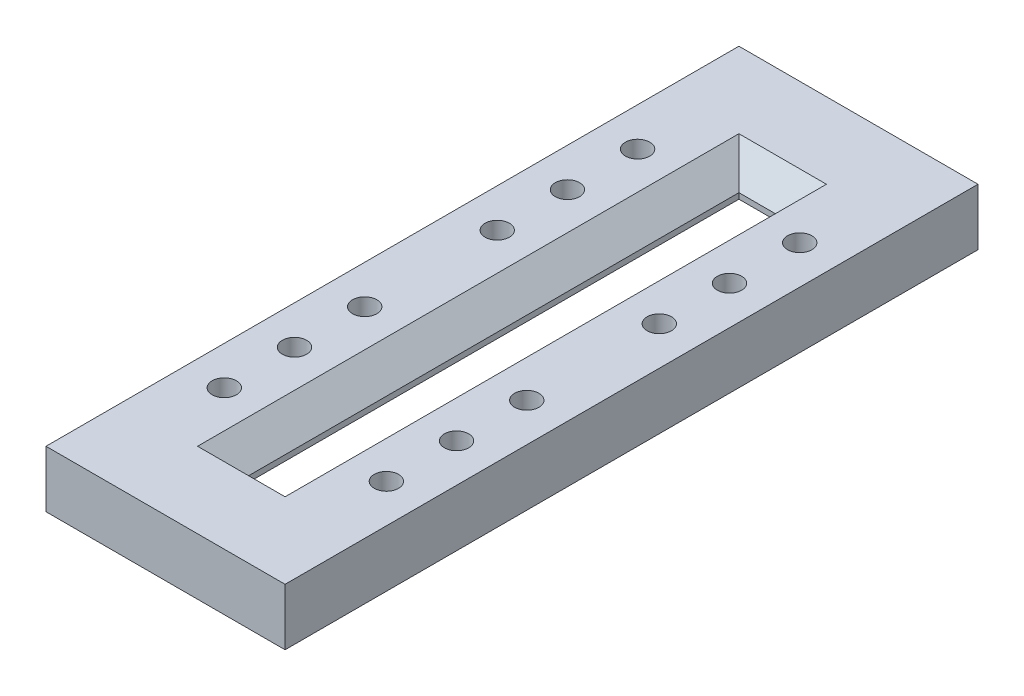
ISO-10303-21;
HEADER;
FILE_DESCRIPTION(('STEP AP214'),'2;1');
FILE_NAME('part.step','',(''),(''),'','','');
FILE_SCHEMA(('AUTOMOTIVE_DESIGN { 1 0 10303 214 1 1 1 1 }'));
ENDSEC;
DATA;
#1=APPLICATION_CONTEXT('core data for automotive mechanical design processes');
#2=APPLICATION_PROTOCOL_DEFINITION('international standard','automotive_design',2000,#1);
#3=PRODUCT_CONTEXT('',#1,'mechanical');
#4=PRODUCT('Part','Part','',(#3));
#5=PRODUCT_RELATED_PRODUCT_CATEGORY('part','',(#4));
#6=PRODUCT_DEFINITION_FORMATION('','',#4);
#7=PRODUCT_DEFINITION_CONTEXT('part definition',#1,'design');
#8=PRODUCT_DEFINITION('design','',#6,#7);
#9=PRODUCT_DEFINITION_SHAPE('','',#8);
#10=(LENGTH_UNIT() NAMED_UNIT(*) SI_UNIT(.MILLI.,.METRE.));
#11=(NAMED_UNIT(*) PLANE_ANGLE_UNIT() SI_UNIT($,.RADIAN.));
#12=(NAMED_UNIT(*) SI_UNIT($,.STERADIAN.) SOLID_ANGLE_UNIT());
#13=UNCERTAINTY_MEASURE_WITH_UNIT(LENGTH_MEASURE(1.E-05),#10,'distance_accuracy_value','');
#14=(GEOMETRIC_REPRESENTATION_CONTEXT(3) GLOBAL_UNCERTAINTY_ASSIGNED_CONTEXT((#13)) GLOBAL_UNIT_ASSIGNED_CONTEXT((#10,
#11,#12)) REPRESENTATION_CONTEXT('',''));
#15=CARTESIAN_POINT('',(0.,0.,0.));
#16=DIRECTION('',(0.,0.,1.));
#17=DIRECTION('',(1.,0.,0.));
#18=AXIS2_PLACEMENT_3D('',#15,#16,#17);
#19=CARTESIAN_POINT('',(0.,88.9,0.));
#20=DIRECTION('',(0.,1.,0.));
#21=DIRECTION('',(0.,0.,1.));
#22=AXIS2_PLACEMENT_3D('',#19,#20,#21);
#23=PLANE('',#22);
#24=DIRECTION('',(0.,0.,-1.));
#25=VECTOR('',#24,1.);
#26=CARTESIAN_POINT('',(-68.5750000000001,88.9,0.));
#27=LINE('',#26,#25);
#28=CARTESIAN_POINT('',(-68.5750000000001,88.9,424.175));
#29=VERTEX_POINT('',#28);
#30=CARTESIAN_POINT('',(-68.5750000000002,88.9,-424.175));
#31=VERTEX_POINT('',#30);
#32=EDGE_CURVE('E212',#29,#31,#27,.T.);
#33=ORIENTED_EDGE('',*,*,#32,.T.);
#34=DIRECTION('',(1.,0.,0.));
#35=VECTOR('',#34,1.);
#36=CARTESIAN_POINT('',(0.,88.9,-424.175));
#37=LINE('',#36,#35);
#38=CARTESIAN_POINT('',(68.5750000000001,88.9,-424.175));
#39=VERTEX_POINT('',#38);
#40=EDGE_CURVE('E11',#31,#39,#37,.T.);
#41=ORIENTED_EDGE('',*,*,#40,.T.);
#42=DIRECTION('',(0.,0.,1.));
#43=VECTOR('',#42,1.);
#44=CARTESIAN_POINT('',(68.5750000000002,88.9,0.));
#45=LINE('',#44,#43);
#46=CARTESIAN_POINT('',(68.5750000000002,88.9,424.175));
#47=VERTEX_POINT('',#46);
#48=EDGE_CURVE('E60',#39,#47,#45,.T.);
#49=ORIENTED_EDGE('',*,*,#48,.T.);
#50=DIRECTION('',(-1.,0.,0.));
#51=VECTOR('',#50,1.);
#52=CARTESIAN_POINT('',(0.,88.9,424.175));
#53=LINE('',#52,#51);
#54=EDGE_CURVE('E211',#47,#29,#53,.T.);
#55=ORIENTED_EDGE('',*,*,#54,.T.);
#56=EDGE_LOOP('',(#33,#41,#49,#55));
#57=FACE_BOUND('',#56,.T.);
#58=CARTESIAN_POINT('',(126.999999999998,88.9,103.85));
#59=DIRECTION('',(0.,1.,0.));
#60=DIRECTION('',(0.,0.,1.));
#61=AXIS2_PLACEMENT_3D('',#58,#59,#60);
#62=CIRCLE('',#61,19.05);
#63=CARTESIAN_POINT('',(126.999999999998,88.9,122.9));
#64=VERTEX_POINT('',#63);
#65=EDGE_CURVE('E398',#64,#64,#62,.T.);
#66=ORIENTED_EDGE('',*,*,#65,.F.);
#67=EDGE_LOOP('',(#66));
#68=FACE_BOUND('',#67,.T.);
#69=CARTESIAN_POINT('',(127.000000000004,88.9,-213.85));
#70=DIRECTION('',(0.,1.,0.));
#71=DIRECTION('',(0.,0.,1.));
#72=AXIS2_PLACEMENT_3D('',#69,#70,#71);
#73=CIRCLE('',#72,19.05);
#74=CARTESIAN_POINT('',(127.000000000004,88.9,-194.8));
#75=VERTEX_POINT('',#74);
#76=EDGE_CURVE('E442',#75,#75,#73,.T.);
#77=ORIENTED_EDGE('',*,*,#76,.F.);
#78=EDGE_LOOP('',(#77));
#79=FACE_BOUND('',#78,.T.);
#80=CARTESIAN_POINT('',(-126.999999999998,88.9,-213.85));
#81=DIRECTION('',(0.,1.,0.));
#82=DIRECTION('',(0.,0.,1.));
#83=AXIS2_PLACEMENT_3D('',#80,#81,#82);
#84=CIRCLE('',#83,19.05);
#85=CARTESIAN_POINT('',(-126.999999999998,88.9,-194.8));
#86=VERTEX_POINT('',#85);
#87=EDGE_CURVE('E434',#86,#86,#84,.T.);
#88=ORIENTED_EDGE('',*,*,#87,.F.);
#89=EDGE_LOOP('',(#88));
#90=FACE_BOUND('',#89,.T.);
#91=CARTESIAN_POINT('',(-127.000000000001,88.9,213.85));
#92=DIRECTION('',(0.,1.,0.));
#93=DIRECTION('',(0.,0.,1.));
#94=AXIS2_PLACEMENT_3D('',#91,#92,#93);
#95=CIRCLE('',#94,19.05);
#96=CARTESIAN_POINT('',(-127.000000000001,88.9,232.9));
#97=VERTEX_POINT('',#96);
#98=EDGE_CURVE('E430',#97,#97,#95,.T.);
#99=ORIENTED_EDGE('',*,*,#98,.F.);
#100=EDGE_LOOP('',(#99));
#101=FACE_BOUND('',#100,.T.);
#102=CARTESIAN_POINT('',(127.000000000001,88.9,213.85));
#103=DIRECTION('',(0.,1.,0.));
#104=DIRECTION('',(0.,0.,1.));
#105=AXIS2_PLACEMENT_3D('',#102,#103,#104);
#106=CIRCLE('',#105,19.05);
#107=CARTESIAN_POINT('',(127.000000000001,88.9,232.9));
#108=VERTEX_POINT('',#107);
#109=EDGE_CURVE('E428',#108,#108,#106,.T.);
#110=ORIENTED_EDGE('',*,*,#109,.F.);
#111=EDGE_LOOP('',(#110));
#112=FACE_BOUND('',#111,.T.);
#113=CARTESIAN_POINT('',(127.000000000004,88.9,-323.85));
#114=DIRECTION('',(0.,1.,0.));
#115=DIRECTION('',(0.,0.,1.));
#116=AXIS2_PLACEMENT_3D('',#113,#114,#115);
#117=CIRCLE('',#116,19.05);
#118=CARTESIAN_POINT('',(127.000000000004,88.9,-304.8));
#119=VERTEX_POINT('',#118);
#120=EDGE_CURVE('E472',#119,#119,#117,.T.);
#121=ORIENTED_EDGE('',*,*,#120,.F.);
#122=EDGE_LOOP('',(#121));
#123=FACE_BOUND('',#122,.T.);
#124=CARTESIAN_POINT('',(-126.999999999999,88.9,-323.85));
#125=DIRECTION('',(0.,1.,0.));
#126=DIRECTION('',(0.,0.,1.));
#127=AXIS2_PLACEMENT_3D('',#124,#125,#126);
#128=CIRCLE('',#127,19.05);
#129=CARTESIAN_POINT('',(-126.999999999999,88.9,-304.8));
#130=VERTEX_POINT('',#129);
#131=EDGE_CURVE('E463',#130,#130,#128,.T.);
#132=ORIENTED_EDGE('',*,*,#131,.F.);
#133=EDGE_LOOP('',(#132));
#134=FACE_BOUND('',#133,.T.);
#135=CARTESIAN_POINT('',(-126.999999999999,88.9,323.85));
#136=DIRECTION('',(0.,1.,0.));
#137=DIRECTION('',(0.,0.,1.));
#138=AXIS2_PLACEMENT_3D('',#135,#136,#137);
#139=CIRCLE('',#138,19.05);
#140=CARTESIAN_POINT('',(-126.999999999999,88.9,342.9));
#141=VERTEX_POINT('',#140);
#142=EDGE_CURVE('E453',#141,#141,#139,.T.);
#143=ORIENTED_EDGE('',*,*,#142,.F.);
#144=EDGE_LOOP('',(#143));
#145=FACE_BOUND('',#144,.T.);
#146=CARTESIAN_POINT('',(-127.000000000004,88.9,103.85));
#147=DIRECTION('',(0.,1.,0.));
#148=DIRECTION('',(0.,0.,1.));
#149=AXIS2_PLACEMENT_3D('',#146,#147,#148);
#150=CIRCLE('',#149,19.05);
#151=CARTESIAN_POINT('',(-127.000000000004,88.9,122.9));
#152=VERTEX_POINT('',#151);
#153=EDGE_CURVE('E391',#152,#152,#150,.T.);
#154=ORIENTED_EDGE('',*,*,#153,.F.);
#155=EDGE_LOOP('',(#154));
#156=FACE_BOUND('',#155,.T.);
#157=CARTESIAN_POINT('',(-126.999999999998,88.9,-103.85));
#158=DIRECTION('',(0.,1.,0.));
#159=DIRECTION('',(0.,0.,1.));
#160=AXIS2_PLACEMENT_3D('',#157,#158,#159);
#161=CIRCLE('',#160,19.05);
#162=CARTESIAN_POINT('',(-126.999999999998,88.9,-84.8000000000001));
#163=VERTEX_POINT('',#162);
#164=EDGE_CURVE('E414',#163,#163,#161,.T.);
#165=ORIENTED_EDGE('',*,*,#164,.F.);
#166=EDGE_LOOP('',(#165));
#167=FACE_BOUND('',#166,.T.);
#168=CARTESIAN_POINT('',(127.000000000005,88.9,-103.85));
#169=DIRECTION('',(0.,1.,0.));
#170=DIRECTION('',(0.,0.,1.));
#171=AXIS2_PLACEMENT_3D('',#168,#169,#170);
#172=CIRCLE('',#171,19.05);
#173=CARTESIAN_POINT('',(127.000000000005,88.9,-84.8000000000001));
#174=VERTEX_POINT('',#173);
#175=EDGE_CURVE('E231',#174,#174,#172,.T.);
#176=ORIENTED_EDGE('',*,*,#175,.F.);
#177=EDGE_LOOP('',(#176));
#178=FACE_BOUND('',#177,.T.);
#179=CARTESIAN_POINT('',(127.000000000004,88.9,323.85));
#180=DIRECTION('',(0.,1.,0.));
#181=DIRECTION('',(0.,0.,1.));
#182=AXIS2_PLACEMENT_3D('',#179,#180,#181);
#183=CIRCLE('',#182,19.05);
#184=CARTESIAN_POINT('',(127.000000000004,88.9,342.9));
#185=VERTEX_POINT('',#184);
#186=EDGE_CURVE('E280',#185,#185,#183,.T.);
#187=ORIENTED_EDGE('',*,*,#186,.F.);
#188=EDGE_LOOP('',(#187));
#189=FACE_BOUND('',#188,.T.);
#190=DIRECTION('',(1.,0.,0.));
#191=VECTOR('',#190,1.);
#192=CARTESIAN_POINT('',(-187.325,88.9,542.925));
#193=LINE('',#192,#191);
#194=CARTESIAN_POINT('',(-187.325,88.9,542.925));
#195=VERTEX_POINT('',#194);
#196=CARTESIAN_POINT('',(187.325,88.9,542.925));
#197=VERTEX_POINT('',#196);
#198=EDGE_CURVE('E154',#195,#197,#193,.T.);
#199=ORIENTED_EDGE('',*,*,#198,.T.);
#200=DIRECTION('',(0.,0.,-1.));
#201=VECTOR('',#200,1.);
#202=CARTESIAN_POINT('',(187.325,88.9,542.925));
#203=LINE('',#202,#201);
#204=CARTESIAN_POINT('',(187.325,88.9,-542.925));
#205=VERTEX_POINT('',#204);
#206=EDGE_CURVE('E139',#197,#205,#203,.T.);
#207=ORIENTED_EDGE('',*,*,#206,.T.);
#208=DIRECTION('',(-1.,0.,0.));
#209=VECTOR('',#208,1.);
#210=CARTESIAN_POINT('',(187.325,88.9,-542.925));
#211=LINE('',#210,#209);
#212=CARTESIAN_POINT('',(-187.325,88.9,-542.925));
#213=VERTEX_POINT('',#212);
#214=EDGE_CURVE('E148',#205,#213,#211,.T.);
#215=ORIENTED_EDGE('',*,*,#214,.T.);
#216=DIRECTION('',(0.,0.,1.));
#217=VECTOR('',#216,1.);
#218=CARTESIAN_POINT('',(-187.325,88.9,-542.925));
#219=LINE('',#218,#217);
#220=EDGE_CURVE('E152',#213,#195,#219,.T.);
#221=ORIENTED_EDGE('',*,*,#220,.T.);
#222=EDGE_LOOP('',(#199,#207,#215,#221));
#223=FACE_BOUND('',#222,.T.);
#224=ADVANCED_FACE('F46',(#57,#68,#79,#90,#101,#112,#123,#134,#145,#156,#167,#178,#189,#223),
#23,.T.);
#225=CARTESIAN_POINT('',(0.,0.,0.));
#226=DIRECTION('',(0.,1.,0.));
#227=DIRECTION('',(0.,0.,1.));
#228=AXIS2_PLACEMENT_3D('',#225,#226,#227);
#229=PLANE('',#228);
#230=DIRECTION('',(-1.,0.,0.));
#231=VECTOR('',#230,1.);
#232=CARTESIAN_POINT('',(-28.575,0.,-424.175));
#233=LINE('',#232,#231);
#234=CARTESIAN_POINT('',(68.5750000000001,0.,-424.175));
#235=VERTEX_POINT('',#234);
#236=CARTESIAN_POINT('',(-68.5750000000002,0.,-424.175));
#237=VERTEX_POINT('',#236);
#238=EDGE_CURVE('E167',#235,#237,#233,.T.);
#239=ORIENTED_EDGE('',*,*,#238,.T.);
#240=DIRECTION('',(0.,0.,1.));
#241=VECTOR('',#240,1.);
#242=CARTESIAN_POINT('',(-68.5750000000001,0.,384.175));
#243=LINE('',#242,#241);
#244=CARTESIAN_POINT('',(-68.5750000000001,0.,424.175));
#245=VERTEX_POINT('',#244);
#246=EDGE_CURVE('E181',#237,#245,#243,.T.);
#247=ORIENTED_EDGE('',*,*,#246,.T.);
#248=DIRECTION('',(1.,0.,0.));
#249=VECTOR('',#248,1.);
#250=CARTESIAN_POINT('',(28.575,0.,424.175));
#251=LINE('',#250,#249);
#252=CARTESIAN_POINT('',(68.5750000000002,0.,424.175));
#253=VERTEX_POINT('',#252);
#254=EDGE_CURVE('E178',#245,#253,#251,.T.);
#255=ORIENTED_EDGE('',*,*,#254,.T.);
#256=DIRECTION('',(0.,0.,-1.));
#257=VECTOR('',#256,1.);
#258=CARTESIAN_POINT('',(68.5750000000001,0.,-384.175));
#259=LINE('',#258,#257);
#260=EDGE_CURVE('E168',#253,#235,#259,.T.);
#261=ORIENTED_EDGE('',*,*,#260,.T.);
#262=EDGE_LOOP('',(#239,#247,#255,#261));
#263=FACE_BOUND('',#262,.T.);
#264=CARTESIAN_POINT('',(126.999999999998,0.,103.85));
#265=DIRECTION('',(0.,1.,0.));
#266=DIRECTION('',(0.,0.,1.));
#267=AXIS2_PLACEMENT_3D('',#264,#265,#266);
#268=CIRCLE('',#267,19.05);
#269=CARTESIAN_POINT('',(126.999999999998,0.,122.9));
#270=VERTEX_POINT('',#269);
#271=EDGE_CURVE('E401',#270,#270,#268,.T.);
#272=ORIENTED_EDGE('',*,*,#271,.T.);
#273=EDGE_LOOP('',(#272));
#274=FACE_BOUND('',#273,.T.);
#275=CARTESIAN_POINT('',(127.000000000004,0.,-213.85));
#276=DIRECTION('',(0.,1.,0.));
#277=DIRECTION('',(0.,0.,1.));
#278=AXIS2_PLACEMENT_3D('',#275,#276,#277);
#279=CIRCLE('',#278,19.05);
#280=CARTESIAN_POINT('',(127.000000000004,0.,-194.8));
#281=VERTEX_POINT('',#280);
#282=EDGE_CURVE('E437',#281,#281,#279,.T.);
#283=ORIENTED_EDGE('',*,*,#282,.T.);
#284=EDGE_LOOP('',(#283));
#285=FACE_BOUND('',#284,.T.);
#286=CARTESIAN_POINT('',(-126.999999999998,0.,-213.85));
#287=DIRECTION('',(0.,1.,0.));
#288=DIRECTION('',(0.,0.,1.));
#289=AXIS2_PLACEMENT_3D('',#286,#287,#288);
#290=CIRCLE('',#289,19.05);
#291=CARTESIAN_POINT('',(-126.999999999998,0.,-194.8));
#292=VERTEX_POINT('',#291);
#293=EDGE_CURVE('E431',#292,#292,#290,.T.);
#294=ORIENTED_EDGE('',*,*,#293,.T.);
#295=EDGE_LOOP('',(#294));
#296=FACE_BOUND('',#295,.T.);
#297=CARTESIAN_POINT('',(-127.000000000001,0.,213.85));
#298=DIRECTION('',(0.,1.,0.));
#299=DIRECTION('',(0.,0.,1.));
#300=AXIS2_PLACEMENT_3D('',#297,#298,#299);
#301=CIRCLE('',#300,19.05);
#302=CARTESIAN_POINT('',(-127.000000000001,0.,232.9));
#303=VERTEX_POINT('',#302);
#304=EDGE_CURVE('E422',#303,#303,#301,.T.);
#305=ORIENTED_EDGE('',*,*,#304,.T.);
#306=EDGE_LOOP('',(#305));
#307=FACE_BOUND('',#306,.T.);
#308=CARTESIAN_POINT('',(127.000000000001,0.,213.85));
#309=DIRECTION('',(0.,1.,0.));
#310=DIRECTION('',(0.,0.,1.));
#311=AXIS2_PLACEMENT_3D('',#308,#309,#310);
#312=CIRCLE('',#311,19.05);
#313=CARTESIAN_POINT('',(127.000000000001,0.,232.9));
#314=VERTEX_POINT('',#313);
#315=EDGE_CURVE('E473',#314,#314,#312,.T.);
#316=ORIENTED_EDGE('',*,*,#315,.T.);
#317=EDGE_LOOP('',(#316));
#318=FACE_BOUND('',#317,.T.);
#319=CARTESIAN_POINT('',(127.000000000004,0.,-323.85));
#320=DIRECTION('',(0.,1.,0.));
#321=DIRECTION('',(0.,0.,1.));
#322=AXIS2_PLACEMENT_3D('',#319,#320,#321);
#323=CIRCLE('',#322,19.05);
#324=CARTESIAN_POINT('',(127.000000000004,0.,-304.8));
#325=VERTEX_POINT('',#324);
#326=EDGE_CURVE('E470',#325,#325,#323,.T.);
#327=ORIENTED_EDGE('',*,*,#326,.T.);
#328=EDGE_LOOP('',(#327));
#329=FACE_BOUND('',#328,.T.);
#330=CARTESIAN_POINT('',(-126.999999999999,0.,-323.85));
#331=DIRECTION('',(0.,1.,0.));
#332=DIRECTION('',(0.,0.,1.));
#333=AXIS2_PLACEMENT_3D('',#330,#331,#332);
#334=CIRCLE('',#333,19.05);
#335=CARTESIAN_POINT('',(-126.999999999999,0.,-304.8));
#336=VERTEX_POINT('',#335);
#337=EDGE_CURVE('E458',#336,#336,#334,.T.);
#338=ORIENTED_EDGE('',*,*,#337,.T.);
#339=EDGE_LOOP('',(#338));
#340=FACE_BOUND('',#339,.T.);
#341=CARTESIAN_POINT('',(-126.999999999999,0.,323.85));
#342=DIRECTION('',(0.,1.,0.));
#343=DIRECTION('',(0.,0.,1.));
#344=AXIS2_PLACEMENT_3D('',#341,#342,#343);
#345=CIRCLE('',#344,19.05);
#346=CARTESIAN_POINT('',(-126.999999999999,0.,342.9));
#347=VERTEX_POINT('',#346);
#348=EDGE_CURVE('E448',#347,#347,#345,.T.);
#349=ORIENTED_EDGE('',*,*,#348,.T.);
#350=EDGE_LOOP('',(#349));
#351=FACE_BOUND('',#350,.T.);
#352=CARTESIAN_POINT('',(-127.000000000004,0.,103.85));
#353=DIRECTION('',(0.,1.,0.));
#354=DIRECTION('',(0.,0.,1.));
#355=AXIS2_PLACEMENT_3D('',#352,#353,#354);
#356=CIRCLE('',#355,19.05);
#357=CARTESIAN_POINT('',(-127.000000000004,0.,122.9));
#358=VERTEX_POINT('',#357);
#359=EDGE_CURVE('E392',#358,#358,#356,.T.);
#360=ORIENTED_EDGE('',*,*,#359,.T.);
#361=EDGE_LOOP('',(#360));
#362=FACE_BOUND('',#361,.T.);
#363=CARTESIAN_POINT('',(-126.999999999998,0.,-103.85));
#364=DIRECTION('',(0.,1.,0.));
#365=DIRECTION('',(0.,0.,1.));
#366=AXIS2_PLACEMENT_3D('',#363,#364,#365);
#367=CIRCLE('',#366,19.05);
#368=CARTESIAN_POINT('',(-126.999999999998,0.,-84.8000000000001));
#369=VERTEX_POINT('',#368);
#370=EDGE_CURVE('E403',#369,#369,#367,.T.);
#371=ORIENTED_EDGE('',*,*,#370,.T.);
#372=EDGE_LOOP('',(#371));
#373=FACE_BOUND('',#372,.T.);
#374=CARTESIAN_POINT('',(127.000000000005,0.,-103.85));
#375=DIRECTION('',(0.,1.,0.));
#376=DIRECTION('',(0.,0.,1.));
#377=AXIS2_PLACEMENT_3D('',#374,#375,#376);
#378=CIRCLE('',#377,19.05);
#379=CARTESIAN_POINT('',(127.000000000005,0.,-84.8000000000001));
#380=VERTEX_POINT('',#379);
#381=EDGE_CURVE('E412',#380,#380,#378,.T.);
#382=ORIENTED_EDGE('',*,*,#381,.T.);
#383=EDGE_LOOP('',(#382));
#384=FACE_BOUND('',#383,.T.);
#385=CARTESIAN_POINT('',(127.000000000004,0.,323.85));
#386=DIRECTION('',(0.,1.,0.));
#387=DIRECTION('',(0.,0.,1.));
#388=AXIS2_PLACEMENT_3D('',#385,#386,#387);
#389=CIRCLE('',#388,19.05);
#390=CARTESIAN_POINT('',(127.000000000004,0.,342.9));
#391=VERTEX_POINT('',#390);
#392=EDGE_CURVE('E451',#391,#391,#389,.T.);
#393=ORIENTED_EDGE('',*,*,#392,.T.);
#394=EDGE_LOOP('',(#393));
#395=FACE_BOUND('',#394,.T.);
#396=DIRECTION('',(1.,0.,0.));
#397=VECTOR('',#396,1.);
#398=CARTESIAN_POINT('',(-187.325,0.,542.925));
#399=LINE('',#398,#397);
#400=CARTESIAN_POINT('',(-187.325,0.,542.925));
#401=VERTEX_POINT('',#400);
#402=CARTESIAN_POINT('',(187.325,0.,542.925));
#403=VERTEX_POINT('',#402);
#404=EDGE_CURVE('E165',#401,#403,#399,.T.);
#405=ORIENTED_EDGE('',*,*,#404,.F.);
#406=DIRECTION('',(0.,0.,1.));
#407=VECTOR('',#406,1.);
#408=CARTESIAN_POINT('',(-187.325,0.,-542.925));
#409=LINE('',#408,#407);
#410=CARTESIAN_POINT('',(-187.325,0.,-542.925));
#411=VERTEX_POINT('',#410);
#412=EDGE_CURVE('E156',#411,#401,#409,.T.);
#413=ORIENTED_EDGE('',*,*,#412,.F.);
#414=DIRECTION('',(-1.,0.,0.));
#415=VECTOR('',#414,1.);
#416=CARTESIAN_POINT('',(187.325,0.,-542.925));
#417=LINE('',#416,#415);
#418=CARTESIAN_POINT('',(187.325,0.,-542.925));
#419=VERTEX_POINT('',#418);
#420=EDGE_CURVE('E295',#419,#411,#417,.T.);
#421=ORIENTED_EDGE('',*,*,#420,.F.);
#422=DIRECTION('',(0.,0.,-1.));
#423=VECTOR('',#422,1.);
#424=CARTESIAN_POINT('',(187.325,0.,542.925));
#425=LINE('',#424,#423);
#426=EDGE_CURVE('E293',#403,#419,#425,.T.);
#427=ORIENTED_EDGE('',*,*,#426,.F.);
#428=EDGE_LOOP('',(#405,#413,#421,#427));
#429=FACE_BOUND('',#428,.T.);
#430=ADVANCED_FACE('F307',(#263,#274,#285,#296,#307,#318,#329,#340,#351,#362,#373,#384,#395,
#429),#229,.F.);
#431=CARTESIAN_POINT('',(-187.325,88.9,542.925));
#432=DIRECTION('',(0.,0.,-1.));
#433=DIRECTION('',(-1.,0.,0.));
#434=AXIS2_PLACEMENT_3D('',#431,#432,#433);
#435=PLANE('',#434);
#436=ORIENTED_EDGE('',*,*,#404,.T.);
#437=DIRECTION('',(0.,-1.,0.));
#438=VECTOR('',#437,1.);
#439=CARTESIAN_POINT('',(187.325,88.9,542.925));
#440=LINE('',#439,#438);
#441=EDGE_CURVE('E141',#197,#403,#440,.T.);
#442=ORIENTED_EDGE('',*,*,#441,.F.);
#443=ORIENTED_EDGE('',*,*,#198,.F.);
#444=DIRECTION('',(0.,-1.,0.));
#445=VECTOR('',#444,1.);
#446=CARTESIAN_POINT('',(-187.325,88.9,542.925));
#447=LINE('',#446,#445);
#448=EDGE_CURVE('E288',#195,#401,#447,.T.);
#449=ORIENTED_EDGE('',*,*,#448,.T.);
#450=EDGE_LOOP('',(#436,#442,#443,#449));
#451=FACE_BOUND('',#450,.T.);
#452=ADVANCED_FACE('F162',(#451),#435,.F.);
#453=CARTESIAN_POINT('',(187.325,88.9,542.925));
#454=DIRECTION('',(-1.,0.,0.));
#455=DIRECTION('',(0.,0.,1.));
#456=AXIS2_PLACEMENT_3D('',#453,#454,#455);
#457=PLANE('',#456);
#458=ORIENTED_EDGE('',*,*,#426,.T.);
#459=DIRECTION('',(0.,-1.,0.));
#460=VECTOR('',#459,1.);
#461=CARTESIAN_POINT('',(187.325,88.9,-542.925));
#462=LINE('',#461,#460);
#463=EDGE_CURVE('E147',#205,#419,#462,.T.);
#464=ORIENTED_EDGE('',*,*,#463,.F.);
#465=ORIENTED_EDGE('',*,*,#206,.F.);
#466=ORIENTED_EDGE('',*,*,#441,.T.);
#467=EDGE_LOOP('',(#458,#464,#465,#466));
#468=FACE_BOUND('',#467,.T.);
#469=ADVANCED_FACE('F142',(#468),#457,.F.);
#470=CARTESIAN_POINT('',(187.325,88.9,-542.925));
#471=DIRECTION('',(0.,0.,1.));
#472=DIRECTION('',(1.,0.,0.));
#473=AXIS2_PLACEMENT_3D('',#470,#471,#472);
#474=PLANE('',#473);
#475=ORIENTED_EDGE('',*,*,#420,.T.);
#476=DIRECTION('',(0.,-1.,0.));
#477=VECTOR('',#476,1.);
#478=CARTESIAN_POINT('',(-187.325,88.9,-542.925));
#479=LINE('',#478,#477);
#480=EDGE_CURVE('E175',#213,#411,#479,.T.);
#481=ORIENTED_EDGE('',*,*,#480,.F.);
#482=ORIENTED_EDGE('',*,*,#214,.F.);
#483=ORIENTED_EDGE('',*,*,#463,.T.);
#484=EDGE_LOOP('',(#475,#481,#482,#483));
#485=FACE_BOUND('',#484,.T.);
#486=ADVANCED_FACE('F309',(#485),#474,.F.);
#487=CARTESIAN_POINT('',(-187.325,88.9,-542.925));
#488=DIRECTION('',(1.,0.,0.));
#489=DIRECTION('',(0.,0.,-1.));
#490=AXIS2_PLACEMENT_3D('',#487,#488,#489);
#491=PLANE('',#490);
#492=ORIENTED_EDGE('',*,*,#412,.T.);
#493=ORIENTED_EDGE('',*,*,#448,.F.);
#494=ORIENTED_EDGE('',*,*,#220,.F.);
#495=ORIENTED_EDGE('',*,*,#480,.T.);
#496=EDGE_LOOP('',(#492,#493,#494,#495));
#497=FACE_BOUND('',#496,.T.);
#498=ADVANCED_FACE('F304',(#497),#491,.F.);
#499=CARTESIAN_POINT('',(-28.5749999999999,88.9,384.175));
#500=DIRECTION('',(0.,0.,-1.));
#501=DIRECTION('',(-1.,0.,0.));
#502=AXIS2_PLACEMENT_3D('',#499,#500,#501);
#503=PLANE('',#502);
#504=DIRECTION('',(0.,-1.,0.));
#505=VECTOR('',#504,1.);
#506=CARTESIAN_POINT('',(28.575,88.9,384.175));
#507=LINE('',#506,#505);
#508=CARTESIAN_POINT('',(28.575,48.9000000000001,384.175));
#509=VERTEX_POINT('',#508);
#510=CARTESIAN_POINT('',(28.575,40.0000000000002,384.175));
#511=VERTEX_POINT('',#510);
#512=EDGE_CURVE('E273',#509,#511,#507,.T.);
#513=ORIENTED_EDGE('',*,*,#512,.T.);
#514=DIRECTION('',(-1.,0.,0.));
#515=VECTOR('',#514,1.);
#516=CARTESIAN_POINT('',(-28.5749999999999,40.0000000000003,384.175));
#517=LINE('',#516,#515);
#518=CARTESIAN_POINT('',(-28.5749999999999,40.0000000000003,384.175));
#519=VERTEX_POINT('',#518);
#520=EDGE_CURVE('E193',#511,#519,#517,.T.);
#521=ORIENTED_EDGE('',*,*,#520,.T.);
#522=DIRECTION('',(0.,-1.,0.));
#523=VECTOR('',#522,1.);
#524=CARTESIAN_POINT('',(-28.5749999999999,88.9,384.175));
#525=LINE('',#524,#523);
#526=CARTESIAN_POINT('',(-28.5749999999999,48.9000000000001,384.175));
#527=VERTEX_POINT('',#526);
#528=EDGE_CURVE('E272',#527,#519,#525,.T.);
#529=ORIENTED_EDGE('',*,*,#528,.F.);
#530=DIRECTION('',(1.,0.,0.));
#531=VECTOR('',#530,1.);
#532=CARTESIAN_POINT('',(-28.5749999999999,48.9000000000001,384.175));
#533=LINE('',#532,#531);
#534=EDGE_CURVE('E195',#527,#509,#533,.T.);
#535=ORIENTED_EDGE('',*,*,#534,.T.);
#536=EDGE_LOOP('',(#513,#521,#529,#535));
#537=FACE_BOUND('',#536,.T.);
#538=ADVANCED_FACE('F320',(#537),#503,.T.);
#539=CARTESIAN_POINT('',(28.575,88.9,384.175));
#540=DIRECTION('',(-1.,0.,0.));
#541=DIRECTION('',(0.,0.,1.));
#542=AXIS2_PLACEMENT_3D('',#539,#540,#541);
#543=PLANE('',#542);
#544=DIRECTION('',(0.,-1.,0.));
#545=VECTOR('',#544,1.);
#546=CARTESIAN_POINT('',(28.5749999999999,88.9,-384.175));
#547=LINE('',#546,#545);
#548=CARTESIAN_POINT('',(28.5749999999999,48.9000000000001,-384.175));
#549=VERTEX_POINT('',#548);
#550=CARTESIAN_POINT('',(28.5749999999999,40.0000000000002,-384.175));
#551=VERTEX_POINT('',#550);
#552=EDGE_CURVE('E270',#549,#551,#547,.T.);
#553=ORIENTED_EDGE('',*,*,#552,.T.);
#554=DIRECTION('',(0.,0.,1.));
#555=VECTOR('',#554,1.);
#556=CARTESIAN_POINT('',(28.575,40.0000000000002,384.175));
#557=LINE('',#556,#555);
#558=EDGE_CURVE('E206',#551,#511,#557,.T.);
#559=ORIENTED_EDGE('',*,*,#558,.T.);
#560=ORIENTED_EDGE('',*,*,#512,.F.);
#561=DIRECTION('',(0.,0.,-1.));
#562=VECTOR('',#561,1.);
#563=CARTESIAN_POINT('',(28.575,48.9000000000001,384.175));
#564=LINE('',#563,#562);
#565=EDGE_CURVE('E201',#509,#549,#564,.T.);
#566=ORIENTED_EDGE('',*,*,#565,.T.);
#567=EDGE_LOOP('',(#553,#559,#560,#566));
#568=FACE_BOUND('',#567,.T.);
#569=ADVANCED_FACE('F332',(#568),#543,.T.);
#570=CARTESIAN_POINT('',(28.5749999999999,88.9,-384.175));
#571=DIRECTION('',(0.,0.,1.));
#572=DIRECTION('',(1.,0.,0.));
#573=AXIS2_PLACEMENT_3D('',#570,#571,#572);
#574=PLANE('',#573);
#575=DIRECTION('',(0.,-1.,0.));
#576=VECTOR('',#575,1.);
#577=CARTESIAN_POINT('',(-28.575,88.9,-384.175));
#578=LINE('',#577,#576);
#579=CARTESIAN_POINT('',(-28.575,48.9000000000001,-384.175));
#580=VERTEX_POINT('',#579);
#581=CARTESIAN_POINT('',(-28.575,40.0000000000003,-384.175));
#582=VERTEX_POINT('',#581);
#583=EDGE_CURVE('E262',#580,#582,#578,.T.);
#584=ORIENTED_EDGE('',*,*,#583,.T.);
#585=DIRECTION('',(1.,0.,0.));
#586=VECTOR('',#585,1.);
#587=CARTESIAN_POINT('',(28.5749999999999,40.0000000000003,-384.175));
#588=LINE('',#587,#586);
#589=EDGE_CURVE('E205',#582,#551,#588,.T.);
#590=ORIENTED_EDGE('',*,*,#589,.T.);
#591=ORIENTED_EDGE('',*,*,#552,.F.);
#592=DIRECTION('',(-1.,0.,0.));
#593=VECTOR('',#592,1.);
#594=CARTESIAN_POINT('',(28.5749999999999,48.9000000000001,-384.175));
#595=LINE('',#594,#593);
#596=EDGE_CURVE('E200',#549,#580,#595,.T.);
#597=ORIENTED_EDGE('',*,*,#596,.T.);
#598=EDGE_LOOP('',(#584,#590,#591,#597));
#599=FACE_BOUND('',#598,.T.);
#600=ADVANCED_FACE('F263',(#599),#574,.T.);
#601=CARTESIAN_POINT('',(-28.575,88.9,-384.175));
#602=DIRECTION('',(1.,0.,0.));
#603=DIRECTION('',(0.,0.,-1.));
#604=AXIS2_PLACEMENT_3D('',#601,#602,#603);
#605=PLANE('',#604);
#606=ORIENTED_EDGE('',*,*,#528,.T.);
#607=DIRECTION('',(0.,0.,-1.));
#608=VECTOR('',#607,1.);
#609=CARTESIAN_POINT('',(-28.575,40.0000000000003,-384.175));
#610=LINE('',#609,#608);
#611=EDGE_CURVE('E189',#519,#582,#610,.T.);
#612=ORIENTED_EDGE('',*,*,#611,.T.);
#613=ORIENTED_EDGE('',*,*,#583,.F.);
#614=DIRECTION('',(0.,0.,1.));
#615=VECTOR('',#614,1.);
#616=CARTESIAN_POINT('',(-28.575,48.9000000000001,-384.175));
#617=LINE('',#616,#615);
#618=EDGE_CURVE('E184',#580,#527,#617,.T.);
#619=ORIENTED_EDGE('',*,*,#618,.T.);
#620=EDGE_LOOP('',(#606,#612,#613,#619));
#621=FACE_BOUND('',#620,.T.);
#622=ADVANCED_FACE('F268',(#621),#605,.T.);
#623=CARTESIAN_POINT('',(127.000000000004,88.9,323.85));
#624=DIRECTION('',(0.,-1.,0.));
#625=DIRECTION('',(0.,0.,-1.));
#626=AXIS2_PLACEMENT_3D('',#623,#624,#625);
#627=CYLINDRICAL_SURFACE('',#626,19.05);
#628=ORIENTED_EDGE('',*,*,#186,.T.);
#629=EDGE_LOOP('',(#628));
#630=FACE_BOUND('',#629,.T.);
#631=ORIENTED_EDGE('',*,*,#392,.F.);
#632=EDGE_LOOP('',(#631));
#633=FACE_BOUND('',#632,.T.);
#634=ADVANCED_FACE('F338',(#630,#633),#627,.F.);
#635=CARTESIAN_POINT('',(127.000000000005,88.9,-103.85));
#636=DIRECTION('',(0.,-1.,0.));
#637=DIRECTION('',(0.,0.,-1.));
#638=AXIS2_PLACEMENT_3D('',#635,#636,#637);
#639=CYLINDRICAL_SURFACE('',#638,19.05);
#640=ORIENTED_EDGE('',*,*,#175,.T.);
#641=EDGE_LOOP('',(#640));
#642=FACE_BOUND('',#641,.T.);
#643=ORIENTED_EDGE('',*,*,#381,.F.);
#644=EDGE_LOOP('',(#643));
#645=FACE_BOUND('',#644,.T.);
#646=ADVANCED_FACE('F344',(#642,#645),#639,.F.);
#647=CARTESIAN_POINT('',(-126.999999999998,88.9,-103.85));
#648=DIRECTION('',(0.,-1.,0.));
#649=DIRECTION('',(0.,0.,-1.));
#650=AXIS2_PLACEMENT_3D('',#647,#648,#649);
#651=CYLINDRICAL_SURFACE('',#650,19.05);
#652=ORIENTED_EDGE('',*,*,#164,.T.);
#653=EDGE_LOOP('',(#652));
#654=FACE_BOUND('',#653,.T.);
#655=ORIENTED_EDGE('',*,*,#370,.F.);
#656=EDGE_LOOP('',(#655));
#657=FACE_BOUND('',#656,.T.);
#658=ADVANCED_FACE('F379',(#654,#657),#651,.F.);
#659=CARTESIAN_POINT('',(-127.000000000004,88.9,103.85));
#660=DIRECTION('',(0.,-1.,0.));
#661=DIRECTION('',(0.,0.,-1.));
#662=AXIS2_PLACEMENT_3D('',#659,#660,#661);
#663=CYLINDRICAL_SURFACE('',#662,19.05);
#664=ORIENTED_EDGE('',*,*,#153,.T.);
#665=EDGE_LOOP('',(#664));
#666=FACE_BOUND('',#665,.T.);
#667=ORIENTED_EDGE('',*,*,#359,.F.);
#668=EDGE_LOOP('',(#667));
#669=FACE_BOUND('',#668,.T.);
#670=ADVANCED_FACE('F363',(#666,#669),#663,.F.);
#671=CARTESIAN_POINT('',(-126.999999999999,88.9,323.85));
#672=DIRECTION('',(0.,-1.,0.));
#673=DIRECTION('',(0.,0.,-1.));
#674=AXIS2_PLACEMENT_3D('',#671,#672,#673);
#675=CYLINDRICAL_SURFACE('',#674,19.05);
#676=ORIENTED_EDGE('',*,*,#142,.T.);
#677=EDGE_LOOP('',(#676));
#678=FACE_BOUND('',#677,.T.);
#679=ORIENTED_EDGE('',*,*,#348,.F.);
#680=EDGE_LOOP('',(#679));
#681=FACE_BOUND('',#680,.T.);
#682=ADVANCED_FACE('F357',(#678,#681),#675,.F.);
#683=CARTESIAN_POINT('',(-126.999999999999,88.9,-323.85));
#684=DIRECTION('',(0.,-1.,0.));
#685=DIRECTION('',(0.,0.,-1.));
#686=AXIS2_PLACEMENT_3D('',#683,#684,#685);
#687=CYLINDRICAL_SURFACE('',#686,19.05);
#688=ORIENTED_EDGE('',*,*,#131,.T.);
#689=EDGE_LOOP('',(#688));
#690=FACE_BOUND('',#689,.T.);
#691=ORIENTED_EDGE('',*,*,#337,.F.);
#692=EDGE_LOOP('',(#691));
#693=FACE_BOUND('',#692,.T.);
#694=ADVANCED_FACE('F353',(#690,#693),#687,.F.);
#695=CARTESIAN_POINT('',(127.000000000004,88.9,-323.85));
#696=DIRECTION('',(0.,-1.,0.));
#697=DIRECTION('',(0.,0.,-1.));
#698=AXIS2_PLACEMENT_3D('',#695,#696,#697);
#699=CYLINDRICAL_SURFACE('',#698,19.05);
#700=ORIENTED_EDGE('',*,*,#120,.T.);
#701=EDGE_LOOP('',(#700));
#702=FACE_BOUND('',#701,.T.);
#703=ORIENTED_EDGE('',*,*,#326,.F.);
#704=EDGE_LOOP('',(#703));
#705=FACE_BOUND('',#704,.T.);
#706=ADVANCED_FACE('F348',(#702,#705),#699,.F.);
#707=CARTESIAN_POINT('',(127.000000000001,88.9,213.85));
#708=DIRECTION('',(0.,-1.,0.));
#709=DIRECTION('',(0.,0.,-1.));
#710=AXIS2_PLACEMENT_3D('',#707,#708,#709);
#711=CYLINDRICAL_SURFACE('',#710,19.05);
#712=ORIENTED_EDGE('',*,*,#109,.T.);
#713=EDGE_LOOP('',(#712));
#714=FACE_BOUND('',#713,.T.);
#715=ORIENTED_EDGE('',*,*,#315,.F.);
#716=EDGE_LOOP('',(#715));
#717=FACE_BOUND('',#716,.T.);
#718=ADVANCED_FACE('F343',(#714,#717),#711,.F.);
#719=CARTESIAN_POINT('',(-127.000000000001,88.9,213.85));
#720=DIRECTION('',(0.,-1.,0.));
#721=DIRECTION('',(0.,0.,-1.));
#722=AXIS2_PLACEMENT_3D('',#719,#720,#721);
#723=CYLINDRICAL_SURFACE('',#722,19.05);
#724=ORIENTED_EDGE('',*,*,#98,.T.);
#725=EDGE_LOOP('',(#724));
#726=FACE_BOUND('',#725,.T.);
#727=ORIENTED_EDGE('',*,*,#304,.F.);
#728=EDGE_LOOP('',(#727));
#729=FACE_BOUND('',#728,.T.);
#730=ADVANCED_FACE('F350',(#726,#729),#723,.F.);
#731=CARTESIAN_POINT('',(-126.999999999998,88.9,-213.85));
#732=DIRECTION('',(0.,-1.,0.));
#733=DIRECTION('',(0.,0.,-1.));
#734=AXIS2_PLACEMENT_3D('',#731,#732,#733);
#735=CYLINDRICAL_SURFACE('',#734,19.05);
#736=ORIENTED_EDGE('',*,*,#87,.T.);
#737=EDGE_LOOP('',(#736));
#738=FACE_BOUND('',#737,.T.);
#739=ORIENTED_EDGE('',*,*,#293,.F.);
#740=EDGE_LOOP('',(#739));
#741=FACE_BOUND('',#740,.T.);
#742=ADVANCED_FACE('F369',(#738,#741),#735,.F.);
#743=CARTESIAN_POINT('',(127.000000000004,88.9,-213.85));
#744=DIRECTION('',(0.,-1.,0.));
#745=DIRECTION('',(0.,0.,-1.));
#746=AXIS2_PLACEMENT_3D('',#743,#744,#745);
#747=CYLINDRICAL_SURFACE('',#746,19.05);
#748=ORIENTED_EDGE('',*,*,#76,.T.);
#749=EDGE_LOOP('',(#748));
#750=FACE_BOUND('',#749,.T.);
#751=ORIENTED_EDGE('',*,*,#282,.F.);
#752=EDGE_LOOP('',(#751));
#753=FACE_BOUND('',#752,.T.);
#754=ADVANCED_FACE('F366',(#750,#753),#747,.F.);
#755=CARTESIAN_POINT('',(126.999999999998,88.9,103.85));
#756=DIRECTION('',(0.,-1.,0.));
#757=DIRECTION('',(0.,0.,-1.));
#758=AXIS2_PLACEMENT_3D('',#755,#756,#757);
#759=CYLINDRICAL_SURFACE('',#758,19.05);
#760=ORIENTED_EDGE('',*,*,#65,.T.);
#761=EDGE_LOOP('',(#760));
#762=FACE_BOUND('',#761,.T.);
#763=ORIENTED_EDGE('',*,*,#271,.F.);
#764=EDGE_LOOP('',(#763));
#765=FACE_BOUND('',#764,.T.);
#766=ADVANCED_FACE('F361',(#762,#765),#759,.F.);
#767=CARTESIAN_POINT('',(68.5750000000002,0.,0.));
#768=DIRECTION('',(-0.707106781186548,-0.707106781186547,0.));
#769=DIRECTION('',(0.,0.,1.));
#770=AXIS2_PLACEMENT_3D('',#767,#768,#769);
#771=PLANE('',#770);
#772=DIRECTION('',(-0.577350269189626,0.577350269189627,-0.577350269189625));
#773=VECTOR('',#772,1.);
#774=CARTESIAN_POINT('',(45.7166666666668,22.8583333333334,401.316666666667));
#775=LINE('',#774,#773);
#776=EDGE_CURVE('E221',#511,#253,#775,.F.);
#777=ORIENTED_EDGE('',*,*,#776,.F.);
#778=ORIENTED_EDGE('',*,*,#558,.F.);
#779=DIRECTION('',(0.577350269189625,-0.577350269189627,-0.577350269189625));
#780=VECTOR('',#779,1.);
#781=CARTESIAN_POINT('',(45.7166666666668,22.8583333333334,-401.316666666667));
#782=LINE('',#781,#780);
#783=EDGE_CURVE('E230',#235,#551,#782,.F.);
#784=ORIENTED_EDGE('',*,*,#783,.F.);
#785=ORIENTED_EDGE('',*,*,#260,.F.);
#786=EDGE_LOOP('',(#777,#778,#784,#785));
#787=FACE_BOUND('',#786,.T.);
#788=ADVANCED_FACE('F362',(#787),#771,.T.);
#789=CARTESIAN_POINT('',(0.,0.,-424.175));
#790=DIRECTION('',(0.,-0.707106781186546,0.707106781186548));
#791=DIRECTION('',(1.,0.,0.));
#792=AXIS2_PLACEMENT_3D('',#789,#790,#791);
#793=PLANE('',#792);
#794=ORIENTED_EDGE('',*,*,#783,.T.);
#795=ORIENTED_EDGE('',*,*,#589,.F.);
#796=DIRECTION('',(-0.577350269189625,-0.577350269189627,-0.577350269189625));
#797=VECTOR('',#796,1.);
#798=CARTESIAN_POINT('',(72.8166666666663,141.391666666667,-282.783333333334));
#799=LINE('',#798,#797);
#800=EDGE_CURVE('E225',#237,#582,#799,.F.);
#801=ORIENTED_EDGE('',*,*,#800,.F.);
#802=ORIENTED_EDGE('',*,*,#238,.F.);
#803=EDGE_LOOP('',(#794,#795,#801,#802));
#804=FACE_BOUND('',#803,.T.);
#805=ADVANCED_FACE('F593',(#804),#793,.T.);
#806=CARTESIAN_POINT('',(0.,0.,424.175));
#807=DIRECTION('',(0.,-0.707106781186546,-0.707106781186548));
#808=DIRECTION('',(-1.,0.,0.));
#809=AXIS2_PLACEMENT_3D('',#806,#807,#808);
#810=PLANE('',#809);
#811=ORIENTED_EDGE('',*,*,#776,.T.);
#812=ORIENTED_EDGE('',*,*,#254,.F.);
#813=DIRECTION('',(0.577350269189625,0.577350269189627,-0.577350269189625));
#814=VECTOR('',#813,1.);
#815=CARTESIAN_POINT('',(72.8166666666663,141.391666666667,282.783333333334));
#816=LINE('',#815,#814);
#817=EDGE_CURVE('E218',#519,#245,#816,.F.);
#818=ORIENTED_EDGE('',*,*,#817,.F.);
#819=ORIENTED_EDGE('',*,*,#520,.F.);
#820=EDGE_LOOP('',(#811,#812,#818,#819));
#821=FACE_BOUND('',#820,.T.);
#822=ADVANCED_FACE('F604',(#821),#810,.T.);
#823=CARTESIAN_POINT('',(-68.5750000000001,0.,0.));
#824=DIRECTION('',(0.707106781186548,-0.707106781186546,0.));
#825=DIRECTION('',(0.,0.,-1.));
#826=AXIS2_PLACEMENT_3D('',#823,#824,#825);
#827=PLANE('',#826);
#828=ORIENTED_EDGE('',*,*,#800,.T.);
#829=ORIENTED_EDGE('',*,*,#611,.F.);
#830=ORIENTED_EDGE('',*,*,#817,.T.);
#831=ORIENTED_EDGE('',*,*,#246,.F.);
#832=EDGE_LOOP('',(#828,#829,#830,#831));
#833=FACE_BOUND('',#832,.T.);
#834=ADVANCED_FACE('F613',(#833),#827,.T.);
#835=CARTESIAN_POINT('',(-28.5749999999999,48.9000000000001,384.175));
#836=DIRECTION('',(0.,-0.707106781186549,0.707106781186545));
#837=DIRECTION('',(1.,0.,0.));
#838=AXIS2_PLACEMENT_3D('',#835,#836,#837);
#839=PLANE('',#838);
#840=DIRECTION('',(0.577350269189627,-0.577350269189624,-0.577350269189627));
#841=VECTOR('',#840,1.);
#842=CARTESIAN_POINT('',(-28.5749999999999,48.9000000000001,384.175));
#843=LINE('',#842,#841);
#844=EDGE_CURVE('E238',#29,#527,#843,.T.);
#845=ORIENTED_EDGE('',*,*,#844,.F.);
#846=ORIENTED_EDGE('',*,*,#54,.F.);
#847=DIRECTION('',(-0.577350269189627,-0.577350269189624,-0.577350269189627));
#848=VECTOR('',#847,1.);
#849=CARTESIAN_POINT('',(28.575,48.9000000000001,384.175));
#850=LINE('',#849,#848);
#851=EDGE_CURVE('E51',#509,#47,#850,.F.);
#852=ORIENTED_EDGE('',*,*,#851,.F.);
#853=ORIENTED_EDGE('',*,*,#534,.F.);
#854=EDGE_LOOP('',(#845,#846,#852,#853));
#855=FACE_BOUND('',#854,.T.);
#856=ADVANCED_FACE('F47',(#855),#839,.F.);
#857=CARTESIAN_POINT('',(28.575,48.9000000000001,384.175));
#858=DIRECTION('',(0.707106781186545,-0.70710678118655,0.));
#859=DIRECTION('',(0.,0.,-1.));
#860=AXIS2_PLACEMENT_3D('',#857,#858,#859);
#861=PLANE('',#860);
#862=ORIENTED_EDGE('',*,*,#851,.T.);
#863=ORIENTED_EDGE('',*,*,#48,.F.);
#864=DIRECTION('',(-0.577350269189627,-0.577350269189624,0.577350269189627));
#865=VECTOR('',#864,1.);
#866=CARTESIAN_POINT('',(28.5749999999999,48.9000000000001,-384.175));
#867=LINE('',#866,#865);
#868=EDGE_CURVE('E63',#549,#39,#867,.F.);
#869=ORIENTED_EDGE('',*,*,#868,.F.);
#870=ORIENTED_EDGE('',*,*,#565,.F.);
#871=EDGE_LOOP('',(#862,#863,#869,#870));
#872=FACE_BOUND('',#871,.T.);
#873=ADVANCED_FACE('F249',(#872),#861,.F.);
#874=CARTESIAN_POINT('',(-28.575,48.9000000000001,-384.175));
#875=DIRECTION('',(-0.707106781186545,-0.707106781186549,0.));
#876=DIRECTION('',(0.,0.,1.));
#877=AXIS2_PLACEMENT_3D('',#874,#875,#876);
#878=PLANE('',#877);
#879=ORIENTED_EDGE('',*,*,#844,.T.);
#880=ORIENTED_EDGE('',*,*,#618,.F.);
#881=DIRECTION('',(-0.577350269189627,0.577350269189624,-0.577350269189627));
#882=VECTOR('',#881,1.);
#883=CARTESIAN_POINT('',(-9.52499999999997,29.8500000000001,-365.125));
#884=LINE('',#883,#882);
#885=EDGE_CURVE('E234',#31,#580,#884,.F.);
#886=ORIENTED_EDGE('',*,*,#885,.F.);
#887=ORIENTED_EDGE('',*,*,#32,.F.);
#888=EDGE_LOOP('',(#879,#880,#886,#887));
#889=FACE_BOUND('',#888,.T.);
#890=ADVANCED_FACE('F257',(#889),#878,.F.);
#891=CARTESIAN_POINT('',(28.5749999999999,48.9000000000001,-384.175));
#892=DIRECTION('',(0.,-0.707106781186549,-0.707106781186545));
#893=DIRECTION('',(-1.,0.,0.));
#894=AXIS2_PLACEMENT_3D('',#891,#892,#893);
#895=PLANE('',#894);
#896=ORIENTED_EDGE('',*,*,#868,.T.);
#897=ORIENTED_EDGE('',*,*,#40,.F.);
#898=ORIENTED_EDGE('',*,*,#885,.T.);
#899=ORIENTED_EDGE('',*,*,#596,.F.);
#900=EDGE_LOOP('',(#896,#897,#898,#899));
#901=FACE_BOUND('',#900,.T.);
#902=ADVANCED_FACE('F253',(#901),#895,.F.);
#903=CLOSED_SHELL('',(#224,#430,#452,#469,#486,#498,#538,#569,#600,#622,#634,#646,#658,#670,
#682,#694,#706,#718,#730,#742,#754,#766,#788,#805,#822,#834,#856,#873,#890,#902));
#904=MANIFOLD_SOLID_BREP('B2',#903);
#905=ADVANCED_BREP_SHAPE_REPRESENTATION('',(#18,#904),#14);
#906=SHAPE_DEFINITION_REPRESENTATION(#9,#905);
ENDSEC;
END-ISO-10303-21;
